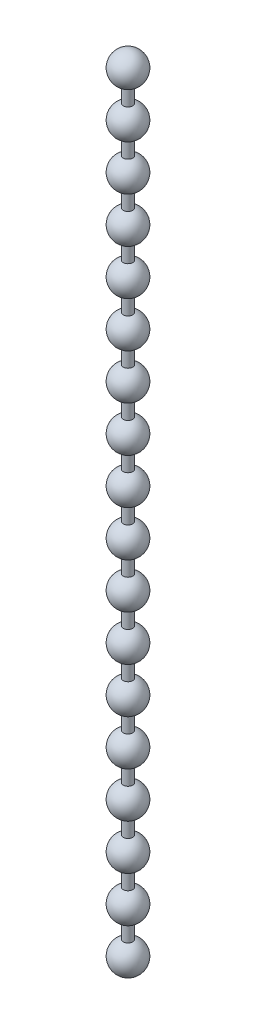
ISO-10303-21;
HEADER;
FILE_DESCRIPTION(('STEP AP214'),'2;1');
FILE_NAME('part.step','',(''),(''),'','','');
FILE_SCHEMA(('AUTOMOTIVE_DESIGN { 1 0 10303 214 1 1 1 1 }'));
ENDSEC;
DATA;
#1=APPLICATION_CONTEXT('core data for automotive mechanical design processes');
#2=APPLICATION_PROTOCOL_DEFINITION('international standard','automotive_design',2000,#1);
#3=PRODUCT_CONTEXT('',#1,'mechanical');
#4=PRODUCT('Part','Part','',(#3));
#5=PRODUCT_RELATED_PRODUCT_CATEGORY('part','',(#4));
#6=PRODUCT_DEFINITION_FORMATION('','',#4);
#7=PRODUCT_DEFINITION_CONTEXT('part definition',#1,'design');
#8=PRODUCT_DEFINITION('design','',#6,#7);
#9=PRODUCT_DEFINITION_SHAPE('','',#8);
#10=(LENGTH_UNIT() NAMED_UNIT(*) SI_UNIT(.MILLI.,.METRE.));
#11=(NAMED_UNIT(*) PLANE_ANGLE_UNIT() SI_UNIT($,.RADIAN.));
#12=(NAMED_UNIT(*) SI_UNIT($,.STERADIAN.) SOLID_ANGLE_UNIT());
#13=UNCERTAINTY_MEASURE_WITH_UNIT(LENGTH_MEASURE(1.E-05),#10,'distance_accuracy_value','');
#14=(GEOMETRIC_REPRESENTATION_CONTEXT(3) GLOBAL_UNCERTAINTY_ASSIGNED_CONTEXT((#13)) GLOBAL_UNIT_ASSIGNED_CONTEXT((#10,
#11,#12)) REPRESENTATION_CONTEXT('',''));
#15=CARTESIAN_POINT('',(0.,0.,0.));
#16=DIRECTION('',(0.,0.,1.));
#17=DIRECTION('',(1.,0.,0.));
#18=AXIS2_PLACEMENT_3D('',#15,#16,#17);
#19=CARTESIAN_POINT('',(-11.2500000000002,-198.63,-27.9452913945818));
#20=DIRECTION('',(0.,1.,0.));
#21=DIRECTION('',(1.,0.,0.));
#22=AXIS2_PLACEMENT_3D('',#19,#20,#21);
#23=SPHERICAL_SURFACE('',#22,3.25);
#24=CARTESIAN_POINT('',(-11.25,-201.88,-27.945291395));
#25=VERTEX_POINT('',#24);
#26=VERTEX_LOOP('',#25);
#27=FACE_BOUND('',#26,.T.);
#28=CARTESIAN_POINT('',(-11.25,-195.537670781,-27.945291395));
#29=DIRECTION('',(0.,1.,0.));
#30=DIRECTION('',(0.,0.,1.));
#31=AXIS2_PLACEMENT_3D('',#28,#29,#30);
#32=CIRCLE('',#31,1.);
#33=CARTESIAN_POINT('',(-11.25,-195.537670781,-26.945291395));
#34=VERTEX_POINT('',#33);
#35=EDGE_CURVE('E35',#34,#34,#32,.F.);
#36=ORIENTED_EDGE('',*,*,#35,.T.);
#37=EDGE_LOOP('',(#36));
#38=FACE_BOUND('',#37,.T.);
#39=ADVANCED_FACE('F15',(#27,#38),#23,.T.);
#40=CARTESIAN_POINT('',(-11.25,-195.537670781,-27.945291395));
#41=DIRECTION('',(0.,1.,0.));
#42=DIRECTION('',(-1.,0.,0.));
#43=AXIS2_PLACEMENT_3D('',#40,#41,#42);
#44=CYLINDRICAL_SURFACE('',#43,1.);
#45=CARTESIAN_POINT('',(-11.25,-192.222329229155,-27.945291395));
#46=DIRECTION('',(0.,1.,0.));
#47=DIRECTION('',(-1.,0.,4.18113473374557E-10));
#48=AXIS2_PLACEMENT_3D('',#45,#46,#47);
#49=CIRCLE('',#48,0.999999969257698);
#50=CARTESIAN_POINT('',(-12.2499999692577,-192.222329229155,-27.9452913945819));
#51=VERTEX_POINT('',#50);
#52=EDGE_CURVE('E37',#51,#51,#49,.F.);
#53=ORIENTED_EDGE('',*,*,#52,.T.);
#54=EDGE_LOOP('',(#53));
#55=FACE_BOUND('',#54,.T.);
#56=ORIENTED_EDGE('',*,*,#35,.F.);
#57=EDGE_LOOP('',(#56));
#58=FACE_BOUND('',#57,.T.);
#59=ADVANCED_FACE('F32',(#55,#58),#44,.T.);
#60=CARTESIAN_POINT('',(-11.2500000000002,-189.13,-27.9452913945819));
#61=DIRECTION('',(0.,1.,0.));
#62=DIRECTION('',(1.,0.,0.));
#63=AXIS2_PLACEMENT_3D('',#60,#61,#62);
#64=SPHERICAL_SURFACE('',#63,3.25);
#65=CARTESIAN_POINT('',(-11.25,-186.037670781,-27.945291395));
#66=DIRECTION('',(0.,1.,0.));
#67=DIRECTION('',(0.,0.,1.));
#68=AXIS2_PLACEMENT_3D('',#65,#66,#67);
#69=CIRCLE('',#68,1.);
#70=CARTESIAN_POINT('',(-11.25,-186.037670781,-26.945291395));
#71=VERTEX_POINT('',#70);
#72=EDGE_CURVE('E39',#71,#71,#69,.F.);
#73=ORIENTED_EDGE('',*,*,#72,.T.);
#74=EDGE_LOOP('',(#73));
#75=FACE_BOUND('',#74,.T.);
#76=ORIENTED_EDGE('',*,*,#52,.F.);
#77=EDGE_LOOP('',(#76));
#78=FACE_BOUND('',#77,.T.);
#79=ADVANCED_FACE('F46',(#75,#78),#64,.T.);
#80=CARTESIAN_POINT('',(-11.25,-186.037670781,-27.945291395));
#81=DIRECTION('',(0.,1.,0.));
#82=DIRECTION('',(0.,0.,1.));
#83=AXIS2_PLACEMENT_3D('',#80,#81,#82);
#84=CYLINDRICAL_SURFACE('',#83,1.);
#85=CARTESIAN_POINT('',(-11.25,-182.722329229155,-27.945291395));
#86=DIRECTION('',(0.,1.,0.));
#87=DIRECTION('',(-1.,0.,4.18144698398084E-10));
#88=AXIS2_PLACEMENT_3D('',#85,#86,#87);
#89=CIRCLE('',#88,0.999999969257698);
#90=CARTESIAN_POINT('',(-12.2499999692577,-182.722329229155,-27.9452913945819));
#91=VERTEX_POINT('',#90);
#92=EDGE_CURVE('E268',#91,#91,#89,.F.);
#93=ORIENTED_EDGE('',*,*,#92,.T.);
#94=EDGE_LOOP('',(#93));
#95=FACE_BOUND('',#94,.T.);
#96=ORIENTED_EDGE('',*,*,#72,.F.);
#97=EDGE_LOOP('',(#96));
#98=FACE_BOUND('',#97,.T.);
#99=ADVANCED_FACE('F49',(#95,#98),#84,.T.);
#100=CARTESIAN_POINT('',(-11.2500000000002,-179.63,-27.9452913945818));
#101=DIRECTION('',(0.,1.,0.));
#102=DIRECTION('',(1.,0.,0.));
#103=AXIS2_PLACEMENT_3D('',#100,#101,#102);
#104=SPHERICAL_SURFACE('',#103,3.25);
#105=ORIENTED_EDGE('',*,*,#92,.F.);
#106=EDGE_LOOP('',(#105));
#107=FACE_BOUND('',#106,.T.);
#108=CARTESIAN_POINT('',(-11.25,-176.537670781,-27.945291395));
#109=DIRECTION('',(0.,1.,0.));
#110=DIRECTION('',(0.,0.,1.));
#111=AXIS2_PLACEMENT_3D('',#108,#109,#110);
#112=CIRCLE('',#111,1.);
#113=CARTESIAN_POINT('',(-11.25,-176.537670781,-26.945291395));
#114=VERTEX_POINT('',#113);
#115=EDGE_CURVE('E265',#114,#114,#112,.F.);
#116=ORIENTED_EDGE('',*,*,#115,.T.);
#117=EDGE_LOOP('',(#116));
#118=FACE_BOUND('',#117,.T.);
#119=ADVANCED_FACE('F270',(#107,#118),#104,.T.);
#120=CARTESIAN_POINT('',(-11.25,-176.537670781,-27.945291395));
#121=DIRECTION('',(0.,1.,0.));
#122=DIRECTION('',(0.,0.,1.));
#123=AXIS2_PLACEMENT_3D('',#120,#121,#122);
#124=CYLINDRICAL_SURFACE('',#123,1.);
#125=ORIENTED_EDGE('',*,*,#115,.F.);
#126=EDGE_LOOP('',(#125));
#127=FACE_BOUND('',#126,.T.);
#128=CARTESIAN_POINT('',(-11.25,-173.222329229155,-27.945291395));
#129=DIRECTION('',(0.,1.,0.));
#130=DIRECTION('',(-1.,0.,4.18075309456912E-10));
#131=AXIS2_PLACEMENT_3D('',#128,#129,#130);
#132=CIRCLE('',#131,0.999999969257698);
#133=CARTESIAN_POINT('',(-12.2499999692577,-173.222329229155,-27.9452913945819));
#134=VERTEX_POINT('',#133);
#135=EDGE_CURVE('E262',#134,#134,#132,.F.);
#136=ORIENTED_EDGE('',*,*,#135,.T.);
#137=EDGE_LOOP('',(#136));
#138=FACE_BOUND('',#137,.T.);
#139=ADVANCED_FACE('F257',(#127,#138),#124,.T.);
#140=CARTESIAN_POINT('',(-11.2500000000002,-170.13,-27.9452913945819));
#141=DIRECTION('',(0.,1.,0.));
#142=DIRECTION('',(1.,0.,0.));
#143=AXIS2_PLACEMENT_3D('',#140,#141,#142);
#144=SPHERICAL_SURFACE('',#143,3.25);
#145=CARTESIAN_POINT('',(-11.25,-167.037670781,-27.945291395));
#146=DIRECTION('',(0.,1.,0.));
#147=DIRECTION('',(0.,0.,1.));
#148=AXIS2_PLACEMENT_3D('',#145,#146,#147);
#149=CIRCLE('',#148,1.);
#150=CARTESIAN_POINT('',(-11.25,-167.037670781,-26.945291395));
#151=VERTEX_POINT('',#150);
#152=EDGE_CURVE('E261',#151,#151,#149,.F.);
#153=ORIENTED_EDGE('',*,*,#152,.T.);
#154=EDGE_LOOP('',(#153));
#155=FACE_BOUND('',#154,.T.);
#156=ORIENTED_EDGE('',*,*,#135,.F.);
#157=EDGE_LOOP('',(#156));
#158=FACE_BOUND('',#157,.T.);
#159=ADVANCED_FACE('F252',(#155,#158),#144,.T.);
#160=CARTESIAN_POINT('',(-11.25,-167.037670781,-27.945291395));
#161=DIRECTION('',(0.,1.,0.));
#162=DIRECTION('',(-1.,0.,0.));
#163=AXIS2_PLACEMENT_3D('',#160,#161,#162);
#164=CYLINDRICAL_SURFACE('',#163,1.);
#165=CARTESIAN_POINT('',(-11.25,-163.722329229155,-27.945291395));
#166=DIRECTION('',(0.,1.,0.));
#167=DIRECTION('',(-1.,0.,4.18113473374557E-10));
#168=AXIS2_PLACEMENT_3D('',#165,#166,#167);
#169=CIRCLE('',#168,0.999999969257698);
#170=CARTESIAN_POINT('',(-12.2499999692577,-163.722329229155,-27.9452913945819));
#171=VERTEX_POINT('',#170);
#172=EDGE_CURVE('E241',#171,#171,#169,.F.);
#173=ORIENTED_EDGE('',*,*,#172,.T.);
#174=EDGE_LOOP('',(#173));
#175=FACE_BOUND('',#174,.T.);
#176=ORIENTED_EDGE('',*,*,#152,.F.);
#177=EDGE_LOOP('',(#176));
#178=FACE_BOUND('',#177,.T.);
#179=ADVANCED_FACE('F248',(#175,#178),#164,.T.);
#180=CARTESIAN_POINT('',(-11.2500000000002,-160.63,-27.9452913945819));
#181=DIRECTION('',(0.,1.,0.));
#182=DIRECTION('',(1.,0.,0.));
#183=AXIS2_PLACEMENT_3D('',#180,#181,#182);
#184=SPHERICAL_SURFACE('',#183,3.25);
#185=ORIENTED_EDGE('',*,*,#172,.F.);
#186=EDGE_LOOP('',(#185));
#187=FACE_BOUND('',#186,.T.);
#188=CARTESIAN_POINT('',(-11.25,-157.537670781,-27.945291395));
#189=DIRECTION('',(0.,1.,0.));
#190=DIRECTION('',(0.,0.,1.));
#191=AXIS2_PLACEMENT_3D('',#188,#189,#190);
#192=CIRCLE('',#191,1.);
#193=CARTESIAN_POINT('',(-11.25,-157.537670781,-26.945291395));
#194=VERTEX_POINT('',#193);
#195=EDGE_CURVE('E238',#194,#194,#192,.F.);
#196=ORIENTED_EDGE('',*,*,#195,.T.);
#197=EDGE_LOOP('',(#196));
#198=FACE_BOUND('',#197,.T.);
#199=ADVANCED_FACE('F245',(#187,#198),#184,.T.);
#200=CARTESIAN_POINT('',(-11.25,-157.537670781,-27.945291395));
#201=DIRECTION('',(0.,1.,0.));
#202=DIRECTION('',(0.,0.,1.));
#203=AXIS2_PLACEMENT_3D('',#200,#201,#202);
#204=CYLINDRICAL_SURFACE('',#203,1.);
#205=ORIENTED_EDGE('',*,*,#195,.F.);
#206=EDGE_LOOP('',(#205));
#207=FACE_BOUND('',#206,.T.);
#208=CARTESIAN_POINT('',(-11.25,-154.222329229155,-27.945291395));
#209=DIRECTION('',(0.,1.,0.));
#210=DIRECTION('',(-1.,0.,4.18144698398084E-10));
#211=AXIS2_PLACEMENT_3D('',#208,#209,#210);
#212=CIRCLE('',#211,0.999999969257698);
#213=CARTESIAN_POINT('',(-12.2499999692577,-154.222329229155,-27.9452913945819));
#214=VERTEX_POINT('',#213);
#215=EDGE_CURVE('E235',#214,#214,#212,.F.);
#216=ORIENTED_EDGE('',*,*,#215,.T.);
#217=EDGE_LOOP('',(#216));
#218=FACE_BOUND('',#217,.T.);
#219=ADVANCED_FACE('F229',(#207,#218),#204,.T.);
#220=CARTESIAN_POINT('',(-11.2500000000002,-151.13,-27.9452913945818));
#221=DIRECTION('',(0.,1.,0.));
#222=DIRECTION('',(1.,0.,0.));
#223=AXIS2_PLACEMENT_3D('',#220,#221,#222);
#224=SPHERICAL_SURFACE('',#223,3.25);
#225=CARTESIAN_POINT('',(-11.25,-148.037670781,-27.945291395));
#226=DIRECTION('',(0.,1.,0.));
#227=DIRECTION('',(0.,0.,1.));
#228=AXIS2_PLACEMENT_3D('',#225,#226,#227);
#229=CIRCLE('',#228,1.);
#230=CARTESIAN_POINT('',(-11.25,-148.037670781,-26.945291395));
#231=VERTEX_POINT('',#230);
#232=EDGE_CURVE('E234',#231,#231,#229,.F.);
#233=ORIENTED_EDGE('',*,*,#232,.T.);
#234=EDGE_LOOP('',(#233));
#235=FACE_BOUND('',#234,.T.);
#236=ORIENTED_EDGE('',*,*,#215,.F.);
#237=EDGE_LOOP('',(#236));
#238=FACE_BOUND('',#237,.T.);
#239=ADVANCED_FACE('F224',(#235,#238),#224,.T.);
#240=CARTESIAN_POINT('',(-11.25,-148.037670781,-27.945291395));
#241=DIRECTION('',(0.,1.,0.));
#242=DIRECTION('',(0.,0.,1.));
#243=AXIS2_PLACEMENT_3D('',#240,#241,#242);
#244=CYLINDRICAL_SURFACE('',#243,1.);
#245=CARTESIAN_POINT('',(-11.25,-144.722329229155,-27.945291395));
#246=DIRECTION('',(0.,1.,0.));
#247=DIRECTION('',(-1.,0.,4.18075309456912E-10));
#248=AXIS2_PLACEMENT_3D('',#245,#246,#247);
#249=CIRCLE('',#248,0.999999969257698);
#250=CARTESIAN_POINT('',(-12.2499999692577,-144.722329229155,-27.9452913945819));
#251=VERTEX_POINT('',#250);
#252=EDGE_CURVE('E213',#251,#251,#249,.F.);
#253=ORIENTED_EDGE('',*,*,#252,.T.);
#254=EDGE_LOOP('',(#253));
#255=FACE_BOUND('',#254,.T.);
#256=ORIENTED_EDGE('',*,*,#232,.F.);
#257=EDGE_LOOP('',(#256));
#258=FACE_BOUND('',#257,.T.);
#259=ADVANCED_FACE('F220',(#255,#258),#244,.T.);
#260=CARTESIAN_POINT('',(-11.2500000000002,-141.63,-27.9452913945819));
#261=DIRECTION('',(0.,1.,0.));
#262=DIRECTION('',(1.,0.,0.));
#263=AXIS2_PLACEMENT_3D('',#260,#261,#262);
#264=SPHERICAL_SURFACE('',#263,3.25);
#265=ORIENTED_EDGE('',*,*,#252,.F.);
#266=EDGE_LOOP('',(#265));
#267=FACE_BOUND('',#266,.T.);
#268=CARTESIAN_POINT('',(-11.25,-138.537670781,-27.945291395));
#269=DIRECTION('',(0.,1.,0.));
#270=DIRECTION('',(0.,0.,1.));
#271=AXIS2_PLACEMENT_3D('',#268,#269,#270);
#272=CIRCLE('',#271,1.);
#273=CARTESIAN_POINT('',(-11.25,-138.537670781,-26.945291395));
#274=VERTEX_POINT('',#273);
#275=EDGE_CURVE('E210',#274,#274,#272,.F.);
#276=ORIENTED_EDGE('',*,*,#275,.T.);
#277=EDGE_LOOP('',(#276));
#278=FACE_BOUND('',#277,.T.);
#279=ADVANCED_FACE('F217',(#267,#278),#264,.T.);
#280=CARTESIAN_POINT('',(-11.25,-138.537670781,-27.945291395));
#281=DIRECTION('',(0.,1.,0.));
#282=DIRECTION('',(0.,0.,1.));
#283=AXIS2_PLACEMENT_3D('',#280,#281,#282);
#284=CYLINDRICAL_SURFACE('',#283,1.);
#285=ORIENTED_EDGE('',*,*,#275,.F.);
#286=EDGE_LOOP('',(#285));
#287=FACE_BOUND('',#286,.T.);
#288=CARTESIAN_POINT('',(-11.25,-135.222329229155,-27.945291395));
#289=DIRECTION('',(0.,1.,0.));
#290=DIRECTION('',(-1.,0.,4.18113473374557E-10));
#291=AXIS2_PLACEMENT_3D('',#288,#289,#290);
#292=CIRCLE('',#291,0.999999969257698);
#293=CARTESIAN_POINT('',(-12.2499999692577,-135.222329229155,-27.9452913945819));
#294=VERTEX_POINT('',#293);
#295=EDGE_CURVE('E207',#294,#294,#292,.F.);
#296=ORIENTED_EDGE('',*,*,#295,.T.);
#297=EDGE_LOOP('',(#296));
#298=FACE_BOUND('',#297,.T.);
#299=ADVANCED_FACE('F201',(#287,#298),#284,.T.);
#300=CARTESIAN_POINT('',(-11.2500000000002,-132.13,-27.9452913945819));
#301=DIRECTION('',(0.,1.,0.));
#302=DIRECTION('',(1.,0.,0.));
#303=AXIS2_PLACEMENT_3D('',#300,#301,#302);
#304=SPHERICAL_SURFACE('',#303,3.25);
#305=CARTESIAN_POINT('',(-11.25,-129.037670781,-27.945291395));
#306=DIRECTION('',(0.,1.,0.));
#307=DIRECTION('',(0.,0.,1.));
#308=AXIS2_PLACEMENT_3D('',#305,#306,#307);
#309=CIRCLE('',#308,1.);
#310=CARTESIAN_POINT('',(-11.25,-129.037670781,-26.945291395));
#311=VERTEX_POINT('',#310);
#312=EDGE_CURVE('E206',#311,#311,#309,.F.);
#313=ORIENTED_EDGE('',*,*,#312,.T.);
#314=EDGE_LOOP('',(#313));
#315=FACE_BOUND('',#314,.T.);
#316=ORIENTED_EDGE('',*,*,#295,.F.);
#317=EDGE_LOOP('',(#316));
#318=FACE_BOUND('',#317,.T.);
#319=ADVANCED_FACE('F196',(#315,#318),#304,.T.);
#320=CARTESIAN_POINT('',(-11.25,-129.037670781,-27.945291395));
#321=DIRECTION('',(0.,1.,0.));
#322=DIRECTION('',(0.,0.,1.));
#323=AXIS2_PLACEMENT_3D('',#320,#321,#322);
#324=CYLINDRICAL_SURFACE('',#323,1.);
#325=CARTESIAN_POINT('',(-11.25,-125.722329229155,-27.945291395));
#326=DIRECTION('',(0.,1.,0.));
#327=DIRECTION('',(-1.,0.,4.18144698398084E-10));
#328=AXIS2_PLACEMENT_3D('',#325,#326,#327);
#329=CIRCLE('',#328,0.999999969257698);
#330=CARTESIAN_POINT('',(-12.2499999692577,-125.722329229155,-27.9452913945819));
#331=VERTEX_POINT('',#330);
#332=EDGE_CURVE('E185',#331,#331,#329,.F.);
#333=ORIENTED_EDGE('',*,*,#332,.T.);
#334=EDGE_LOOP('',(#333));
#335=FACE_BOUND('',#334,.T.);
#336=ORIENTED_EDGE('',*,*,#312,.F.);
#337=EDGE_LOOP('',(#336));
#338=FACE_BOUND('',#337,.T.);
#339=ADVANCED_FACE('F192',(#335,#338),#324,.T.);
#340=CARTESIAN_POINT('',(-11.2500000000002,-122.63,-27.9452913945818));
#341=DIRECTION('',(0.,1.,0.));
#342=DIRECTION('',(1.,0.,0.));
#343=AXIS2_PLACEMENT_3D('',#340,#341,#342);
#344=SPHERICAL_SURFACE('',#343,3.25);
#345=ORIENTED_EDGE('',*,*,#332,.F.);
#346=EDGE_LOOP('',(#345));
#347=FACE_BOUND('',#346,.T.);
#348=CARTESIAN_POINT('',(-11.25,-119.537670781,-27.945291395));
#349=DIRECTION('',(0.,1.,0.));
#350=DIRECTION('',(0.,0.,1.));
#351=AXIS2_PLACEMENT_3D('',#348,#349,#350);
#352=CIRCLE('',#351,1.);
#353=CARTESIAN_POINT('',(-11.25,-119.537670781,-26.945291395));
#354=VERTEX_POINT('',#353);
#355=EDGE_CURVE('E182',#354,#354,#352,.F.);
#356=ORIENTED_EDGE('',*,*,#355,.T.);
#357=EDGE_LOOP('',(#356));
#358=FACE_BOUND('',#357,.T.);
#359=ADVANCED_FACE('F189',(#347,#358),#344,.T.);
#360=CARTESIAN_POINT('',(-11.25,-119.537670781,-27.945291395));
#361=DIRECTION('',(0.,1.,0.));
#362=DIRECTION('',(-1.,0.,0.));
#363=AXIS2_PLACEMENT_3D('',#360,#361,#362);
#364=CYLINDRICAL_SURFACE('',#363,1.);
#365=ORIENTED_EDGE('',*,*,#355,.F.);
#366=EDGE_LOOP('',(#365));
#367=FACE_BOUND('',#366,.T.);
#368=CARTESIAN_POINT('',(-11.25,-116.222329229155,-27.945291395));
#369=DIRECTION('',(0.,1.,0.));
#370=DIRECTION('',(-1.,0.,4.18075309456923E-10));
#371=AXIS2_PLACEMENT_3D('',#368,#369,#370);
#372=CIRCLE('',#371,0.99999996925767);
#373=CARTESIAN_POINT('',(-12.2499999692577,-116.222329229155,-27.9452913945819));
#374=VERTEX_POINT('',#373);
#375=EDGE_CURVE('E179',#374,#374,#372,.F.);
#376=ORIENTED_EDGE('',*,*,#375,.T.);
#377=EDGE_LOOP('',(#376));
#378=FACE_BOUND('',#377,.T.);
#379=ADVANCED_FACE('F173',(#367,#378),#364,.T.);
#380=CARTESIAN_POINT('',(-11.2500000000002,-113.13,-27.9452913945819));
#381=DIRECTION('',(0.,1.,0.));
#382=DIRECTION('',(1.,0.,0.));
#383=AXIS2_PLACEMENT_3D('',#380,#381,#382);
#384=SPHERICAL_SURFACE('',#383,3.25);
#385=CARTESIAN_POINT('',(-11.25,-110.037670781,-27.945291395));
#386=DIRECTION('',(0.,1.,0.));
#387=DIRECTION('',(0.,0.,1.));
#388=AXIS2_PLACEMENT_3D('',#385,#386,#387);
#389=CIRCLE('',#388,1.);
#390=CARTESIAN_POINT('',(-11.25,-110.037670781,-26.945291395));
#391=VERTEX_POINT('',#390);
#392=EDGE_CURVE('E178',#391,#391,#389,.F.);
#393=ORIENTED_EDGE('',*,*,#392,.T.);
#394=EDGE_LOOP('',(#393));
#395=FACE_BOUND('',#394,.T.);
#396=ORIENTED_EDGE('',*,*,#375,.F.);
#397=EDGE_LOOP('',(#396));
#398=FACE_BOUND('',#397,.T.);
#399=ADVANCED_FACE('F168',(#395,#398),#384,.T.);
#400=CARTESIAN_POINT('',(-11.25,-110.037670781,-27.945291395));
#401=DIRECTION('',(0.,1.,0.));
#402=DIRECTION('',(-1.,0.,0.));
#403=AXIS2_PLACEMENT_3D('',#400,#401,#402);
#404=CYLINDRICAL_SURFACE('',#403,1.);
#405=CARTESIAN_POINT('',(-11.25,-106.722329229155,-27.945291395));
#406=DIRECTION('',(0.,1.,0.));
#407=DIRECTION('',(-1.,0.,4.18120412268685E-10));
#408=AXIS2_PLACEMENT_3D('',#405,#406,#407);
#409=CIRCLE('',#408,0.99999996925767);
#410=CARTESIAN_POINT('',(-12.2499999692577,-106.722329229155,-27.9452913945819));
#411=VERTEX_POINT('',#410);
#412=EDGE_CURVE('E157',#411,#411,#409,.F.);
#413=ORIENTED_EDGE('',*,*,#412,.T.);
#414=EDGE_LOOP('',(#413));
#415=FACE_BOUND('',#414,.T.);
#416=ORIENTED_EDGE('',*,*,#392,.F.);
#417=EDGE_LOOP('',(#416));
#418=FACE_BOUND('',#417,.T.);
#419=ADVANCED_FACE('F164',(#415,#418),#404,.T.);
#420=CARTESIAN_POINT('',(-11.2500000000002,-103.63,-27.9452913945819));
#421=DIRECTION('',(0.,1.,0.));
#422=DIRECTION('',(1.,0.,0.));
#423=AXIS2_PLACEMENT_3D('',#420,#421,#422);
#424=SPHERICAL_SURFACE('',#423,3.25);
#425=ORIENTED_EDGE('',*,*,#412,.F.);
#426=EDGE_LOOP('',(#425));
#427=FACE_BOUND('',#426,.T.);
#428=CARTESIAN_POINT('',(-11.25,-100.537670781,-27.945291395));
#429=DIRECTION('',(0.,1.,0.));
#430=DIRECTION('',(0.,0.,1.));
#431=AXIS2_PLACEMENT_3D('',#428,#429,#430);
#432=CIRCLE('',#431,1.);
#433=CARTESIAN_POINT('',(-11.25,-100.537670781,-26.945291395));
#434=VERTEX_POINT('',#433);
#435=EDGE_CURVE('E154',#434,#434,#432,.F.);
#436=ORIENTED_EDGE('',*,*,#435,.T.);
#437=EDGE_LOOP('',(#436));
#438=FACE_BOUND('',#437,.T.);
#439=ADVANCED_FACE('F161',(#427,#438),#424,.T.);
#440=CARTESIAN_POINT('',(-11.25,-100.537670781,-27.945291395));
#441=DIRECTION('',(0.,1.,0.));
#442=DIRECTION('',(-1.,0.,0.));
#443=AXIS2_PLACEMENT_3D('',#440,#441,#442);
#444=CYLINDRICAL_SURFACE('',#443,1.);
#445=ORIENTED_EDGE('',*,*,#435,.F.);
#446=EDGE_LOOP('',(#445));
#447=FACE_BOUND('',#446,.T.);
#448=CARTESIAN_POINT('',(-11.25,-97.2223292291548,-27.945291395));
#449=DIRECTION('',(0.,1.,0.));
#450=DIRECTION('',(-1.,0.,4.18151637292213E-10));
#451=AXIS2_PLACEMENT_3D('',#448,#449,#450);
#452=CIRCLE('',#451,0.99999996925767);
#453=CARTESIAN_POINT('',(-12.2499999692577,-97.2223292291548,-27.9452913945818));
#454=VERTEX_POINT('',#453);
#455=EDGE_CURVE('E151',#454,#454,#452,.F.);
#456=ORIENTED_EDGE('',*,*,#455,.T.);
#457=EDGE_LOOP('',(#456));
#458=FACE_BOUND('',#457,.T.);
#459=ADVANCED_FACE('F145',(#447,#458),#444,.T.);
#460=CARTESIAN_POINT('',(-11.2500000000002,-94.13,-27.9452913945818));
#461=DIRECTION('',(0.,1.,0.));
#462=DIRECTION('',(1.,0.,0.));
#463=AXIS2_PLACEMENT_3D('',#460,#461,#462);
#464=SPHERICAL_SURFACE('',#463,3.25);
#465=CARTESIAN_POINT('',(-11.25,-91.037670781,-27.945291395));
#466=DIRECTION('',(0.,1.,0.));
#467=DIRECTION('',(0.,0.,1.));
#468=AXIS2_PLACEMENT_3D('',#465,#466,#467);
#469=CIRCLE('',#468,1.);
#470=CARTESIAN_POINT('',(-11.25,-91.037670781,-26.945291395));
#471=VERTEX_POINT('',#470);
#472=EDGE_CURVE('E150',#471,#471,#469,.F.);
#473=ORIENTED_EDGE('',*,*,#472,.T.);
#474=EDGE_LOOP('',(#473));
#475=FACE_BOUND('',#474,.T.);
#476=ORIENTED_EDGE('',*,*,#455,.F.);
#477=EDGE_LOOP('',(#476));
#478=FACE_BOUND('',#477,.T.);
#479=ADVANCED_FACE('F140',(#475,#478),#464,.T.);
#480=CARTESIAN_POINT('',(-11.25,-91.037670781,-27.945291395));
#481=DIRECTION('',(0.,1.,0.));
#482=DIRECTION('',(0.,0.,1.));
#483=AXIS2_PLACEMENT_3D('',#480,#481,#482);
#484=CYLINDRICAL_SURFACE('',#483,1.);
#485=CARTESIAN_POINT('',(-11.25,-87.7223292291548,-27.945291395));
#486=DIRECTION('',(0.,1.,0.));
#487=DIRECTION('',(-1.,0.,4.18182862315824E-10));
#488=AXIS2_PLACEMENT_3D('',#485,#486,#487);
#489=CIRCLE('',#488,0.999999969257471);
#490=CARTESIAN_POINT('',(-12.2499999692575,-87.7223292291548,-27.9452913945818));
#491=VERTEX_POINT('',#490);
#492=EDGE_CURVE('E129',#491,#491,#489,.F.);
#493=ORIENTED_EDGE('',*,*,#492,.T.);
#494=EDGE_LOOP('',(#493));
#495=FACE_BOUND('',#494,.T.);
#496=ORIENTED_EDGE('',*,*,#472,.F.);
#497=EDGE_LOOP('',(#496));
#498=FACE_BOUND('',#497,.T.);
#499=ADVANCED_FACE('F136',(#495,#498),#484,.T.);
#500=CARTESIAN_POINT('',(-11.25,-84.63,-27.9452913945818));
#501=DIRECTION('',(0.,1.,0.));
#502=DIRECTION('',(1.,0.,0.));
#503=AXIS2_PLACEMENT_3D('',#500,#501,#502);
#504=SPHERICAL_SURFACE('',#503,3.25);
#505=ORIENTED_EDGE('',*,*,#492,.F.);
#506=EDGE_LOOP('',(#505));
#507=FACE_BOUND('',#506,.T.);
#508=CARTESIAN_POINT('',(-11.25,-81.537670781,-27.945291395));
#509=DIRECTION('',(0.,1.,0.));
#510=DIRECTION('',(0.,0.,1.));
#511=AXIS2_PLACEMENT_3D('',#508,#509,#510);
#512=CIRCLE('',#511,1.);
#513=CARTESIAN_POINT('',(-11.25,-81.537670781,-26.945291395));
#514=VERTEX_POINT('',#513);
#515=EDGE_CURVE('E126',#514,#514,#512,.F.);
#516=ORIENTED_EDGE('',*,*,#515,.T.);
#517=EDGE_LOOP('',(#516));
#518=FACE_BOUND('',#517,.T.);
#519=ADVANCED_FACE('F133',(#507,#518),#504,.T.);
#520=CARTESIAN_POINT('',(-11.25,-81.537670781,-27.945291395));
#521=DIRECTION('',(0.,1.,0.));
#522=DIRECTION('',(0.,0.,1.));
#523=AXIS2_PLACEMENT_3D('',#520,#521,#522);
#524=CYLINDRICAL_SURFACE('',#523,1.);
#525=ORIENTED_EDGE('',*,*,#515,.F.);
#526=EDGE_LOOP('',(#525));
#527=FACE_BOUND('',#526,.T.);
#528=CARTESIAN_POINT('',(-11.25,-78.2223292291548,-27.945291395));
#529=DIRECTION('',(0.,1.,0.));
#530=DIRECTION('',(-1.,0.,4.18120412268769E-10));
#531=AXIS2_PLACEMENT_3D('',#528,#529,#530);
#532=CIRCLE('',#531,0.999999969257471);
#533=CARTESIAN_POINT('',(-12.2499999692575,-78.2223292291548,-27.9452913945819));
#534=VERTEX_POINT('',#533);
#535=EDGE_CURVE('E123',#534,#534,#532,.F.);
#536=ORIENTED_EDGE('',*,*,#535,.T.);
#537=EDGE_LOOP('',(#536));
#538=FACE_BOUND('',#537,.T.);
#539=ADVANCED_FACE('F117',(#527,#538),#524,.T.);
#540=CARTESIAN_POINT('',(-11.25,-75.13,-27.9452913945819));
#541=DIRECTION('',(0.,1.,0.));
#542=DIRECTION('',(1.,0.,0.));
#543=AXIS2_PLACEMENT_3D('',#540,#541,#542);
#544=SPHERICAL_SURFACE('',#543,3.25);
#545=CARTESIAN_POINT('',(-11.25,-72.037670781,-27.945291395));
#546=DIRECTION('',(0.,1.,0.));
#547=DIRECTION('',(0.,0.,1.));
#548=AXIS2_PLACEMENT_3D('',#545,#546,#547);
#549=CIRCLE('',#548,1.);
#550=CARTESIAN_POINT('',(-11.25,-72.037670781,-26.945291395));
#551=VERTEX_POINT('',#550);
#552=EDGE_CURVE('E122',#551,#551,#549,.F.);
#553=ORIENTED_EDGE('',*,*,#552,.T.);
#554=EDGE_LOOP('',(#553));
#555=FACE_BOUND('',#554,.T.);
#556=ORIENTED_EDGE('',*,*,#535,.F.);
#557=EDGE_LOOP('',(#556));
#558=FACE_BOUND('',#557,.T.);
#559=ADVANCED_FACE('F112',(#555,#558),#544,.T.);
#560=CARTESIAN_POINT('',(-11.25,-72.037670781,-27.945291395));
#561=DIRECTION('',(0.,1.,0.));
#562=DIRECTION('',(0.,0.,1.));
#563=AXIS2_PLACEMENT_3D('',#560,#561,#562);
#564=CYLINDRICAL_SURFACE('',#563,1.);
#565=CARTESIAN_POINT('',(-11.25,-68.7223292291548,-27.945291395));
#566=DIRECTION('',(0.,1.,0.));
#567=DIRECTION('',(-1.,0.,4.18151637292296E-10));
#568=AXIS2_PLACEMENT_3D('',#565,#566,#567);
#569=CIRCLE('',#568,0.999999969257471);
#570=CARTESIAN_POINT('',(-12.2499999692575,-68.7223292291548,-27.9452913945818));
#571=VERTEX_POINT('',#570);
#572=EDGE_CURVE('E101',#571,#571,#569,.F.);
#573=ORIENTED_EDGE('',*,*,#572,.T.);
#574=EDGE_LOOP('',(#573));
#575=FACE_BOUND('',#574,.T.);
#576=ORIENTED_EDGE('',*,*,#552,.F.);
#577=EDGE_LOOP('',(#576));
#578=FACE_BOUND('',#577,.T.);
#579=ADVANCED_FACE('F108',(#575,#578),#564,.T.);
#580=CARTESIAN_POINT('',(-11.25,-65.63,-27.9452913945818));
#581=DIRECTION('',(0.,1.,0.));
#582=DIRECTION('',(1.,0.,0.));
#583=AXIS2_PLACEMENT_3D('',#580,#581,#582);
#584=SPHERICAL_SURFACE('',#583,3.25);
#585=ORIENTED_EDGE('',*,*,#572,.F.);
#586=EDGE_LOOP('',(#585));
#587=FACE_BOUND('',#586,.T.);
#588=CARTESIAN_POINT('',(-11.25,-62.537670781,-27.945291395));
#589=DIRECTION('',(0.,1.,0.));
#590=DIRECTION('',(0.,0.,1.));
#591=AXIS2_PLACEMENT_3D('',#588,#589,#590);
#592=CIRCLE('',#591,1.);
#593=CARTESIAN_POINT('',(-11.25,-62.537670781,-26.945291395));
#594=VERTEX_POINT('',#593);
#595=EDGE_CURVE('E98',#594,#594,#592,.F.);
#596=ORIENTED_EDGE('',*,*,#595,.T.);
#597=EDGE_LOOP('',(#596));
#598=FACE_BOUND('',#597,.T.);
#599=ADVANCED_FACE('F105',(#587,#598),#584,.T.);
#600=CARTESIAN_POINT('',(-11.25,-62.537670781,-27.945291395));
#601=DIRECTION('',(0.,1.,0.));
#602=DIRECTION('',(0.,0.,1.));
#603=AXIS2_PLACEMENT_3D('',#600,#601,#602);
#604=CYLINDRICAL_SURFACE('',#603,1.);
#605=ORIENTED_EDGE('',*,*,#595,.F.);
#606=EDGE_LOOP('',(#605));
#607=FACE_BOUND('',#606,.T.);
#608=CARTESIAN_POINT('',(-11.25,-59.2223292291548,-27.945291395));
#609=DIRECTION('',(0.,1.,0.));
#610=DIRECTION('',(-1.,0.,4.1808224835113E-10));
#611=AXIS2_PLACEMENT_3D('',#608,#609,#610);
#612=CIRCLE('',#611,0.999999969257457);
#613=CARTESIAN_POINT('',(-12.2499999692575,-59.2223292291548,-27.9452913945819));
#614=VERTEX_POINT('',#613);
#615=EDGE_CURVE('E95',#614,#614,#612,.F.);
#616=ORIENTED_EDGE('',*,*,#615,.T.);
#617=EDGE_LOOP('',(#616));
#618=FACE_BOUND('',#617,.T.);
#619=ADVANCED_FACE('F89',(#607,#618),#604,.T.);
#620=CARTESIAN_POINT('',(-11.25,-56.13,-27.9452913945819));
#621=DIRECTION('',(0.,1.,0.));
#622=DIRECTION('',(1.,0.,0.));
#623=AXIS2_PLACEMENT_3D('',#620,#621,#622);
#624=SPHERICAL_SURFACE('',#623,3.25);
#625=CARTESIAN_POINT('',(-11.25,-53.037670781,-27.945291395));
#626=DIRECTION('',(0.,1.,0.));
#627=DIRECTION('',(0.,0.,1.));
#628=AXIS2_PLACEMENT_3D('',#625,#626,#627);
#629=CIRCLE('',#628,1.);
#630=CARTESIAN_POINT('',(-11.25,-53.037670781,-26.945291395));
#631=VERTEX_POINT('',#630);
#632=EDGE_CURVE('E94',#631,#631,#629,.F.);
#633=ORIENTED_EDGE('',*,*,#632,.T.);
#634=EDGE_LOOP('',(#633));
#635=FACE_BOUND('',#634,.T.);
#636=ORIENTED_EDGE('',*,*,#615,.F.);
#637=EDGE_LOOP('',(#636));
#638=FACE_BOUND('',#637,.T.);
#639=ADVANCED_FACE('F84',(#635,#638),#624,.T.);
#640=CARTESIAN_POINT('',(-11.25,-53.037670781,-27.945291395));
#641=DIRECTION('',(0.,1.,0.));
#642=DIRECTION('',(0.,0.,1.));
#643=AXIS2_PLACEMENT_3D('',#640,#641,#642);
#644=CYLINDRICAL_SURFACE('',#643,1.);
#645=CARTESIAN_POINT('',(-11.25,-49.7223292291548,-27.945291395));
#646=DIRECTION('',(0.,1.,0.));
#647=DIRECTION('',(-1.,0.,4.18120412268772E-10));
#648=AXIS2_PLACEMENT_3D('',#645,#646,#647);
#649=CIRCLE('',#648,0.999999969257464);
#650=CARTESIAN_POINT('',(-12.2499999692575,-49.7223292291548,-27.9452913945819));
#651=VERTEX_POINT('',#650);
#652=EDGE_CURVE('E74',#651,#651,#649,.F.);
#653=ORIENTED_EDGE('',*,*,#652,.T.);
#654=EDGE_LOOP('',(#653));
#655=FACE_BOUND('',#654,.T.);
#656=ORIENTED_EDGE('',*,*,#632,.F.);
#657=EDGE_LOOP('',(#656));
#658=FACE_BOUND('',#657,.T.);
#659=ADVANCED_FACE('F80',(#655,#658),#644,.T.);
#660=CARTESIAN_POINT('',(-11.25,-46.63,-27.9452913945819));
#661=DIRECTION('',(0.,1.,0.));
#662=DIRECTION('',(1.,0.,0.));
#663=AXIS2_PLACEMENT_3D('',#660,#661,#662);
#664=SPHERICAL_SURFACE('',#663,3.25);
#665=ORIENTED_EDGE('',*,*,#652,.F.);
#666=EDGE_LOOP('',(#665));
#667=FACE_BOUND('',#666,.T.);
#668=CARTESIAN_POINT('',(-11.25,-43.537670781,-27.945291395));
#669=DIRECTION('',(0.,1.,0.));
#670=DIRECTION('',(0.,0.,1.));
#671=AXIS2_PLACEMENT_3D('',#668,#669,#670);
#672=CIRCLE('',#671,1.);
#673=CARTESIAN_POINT('',(-11.25,-43.537670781,-26.945291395));
#674=VERTEX_POINT('',#673);
#675=EDGE_CURVE('E24',#674,#674,#672,.F.);
#676=ORIENTED_EDGE('',*,*,#675,.T.);
#677=EDGE_LOOP('',(#676));
#678=FACE_BOUND('',#677,.T.);
#679=ADVANCED_FACE('F64',(#667,#678),#664,.T.);
#680=CARTESIAN_POINT('',(-11.25,-43.537670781,-27.945291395));
#681=DIRECTION('',(0.,1.,0.));
#682=DIRECTION('',(-1.,0.,0.));
#683=AXIS2_PLACEMENT_3D('',#680,#681,#682);
#684=CYLINDRICAL_SURFACE('',#683,1.);
#685=ORIENTED_EDGE('',*,*,#675,.F.);
#686=EDGE_LOOP('',(#685));
#687=FACE_BOUND('',#686,.T.);
#688=CARTESIAN_POINT('',(-11.25,-40.2223292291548,-27.945291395));
#689=DIRECTION('',(0.,1.,0.));
#690=DIRECTION('',(-1.,0.,4.18151637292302E-10));
#691=AXIS2_PLACEMENT_3D('',#688,#689,#690);
#692=CIRCLE('',#691,0.999999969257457);
#693=CARTESIAN_POINT('',(-12.2499999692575,-40.2223292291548,-27.9452913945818));
#694=VERTEX_POINT('',#693);
#695=EDGE_CURVE('E10',#694,#694,#692,.F.);
#696=ORIENTED_EDGE('',*,*,#695,.T.);
#697=EDGE_LOOP('',(#696));
#698=FACE_BOUND('',#697,.T.);
#699=ADVANCED_FACE('F59',(#687,#698),#684,.T.);
#700=CARTESIAN_POINT('',(-11.25,-37.13,-27.9452913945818));
#701=DIRECTION('',(0.,1.,0.));
#702=DIRECTION('',(1.,0.,0.));
#703=AXIS2_PLACEMENT_3D('',#700,#701,#702);
#704=SPHERICAL_SURFACE('',#703,3.25);
#705=CARTESIAN_POINT('',(-11.25,-33.88,-27.945291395));
#706=VERTEX_POINT('',#705);
#707=VERTEX_LOOP('',#706);
#708=FACE_BOUND('',#707,.T.);
#709=ORIENTED_EDGE('',*,*,#695,.F.);
#710=EDGE_LOOP('',(#709));
#711=FACE_BOUND('',#710,.T.);
#712=ADVANCED_FACE('F57',(#708,#711),#704,.T.);
#713=CLOSED_SHELL('',(#39,#59,#79,#99,#119,#139,#159,#179,#199,#219,#239,#259,#279,#299,#319,
#339,#359,#379,#399,#419,#439,#459,#479,#499,#519,#539,#559,#579,#599,#619,#639,#659,#679,#699,#712));
#714=MANIFOLD_SOLID_BREP('B1',#713);
#715=ADVANCED_BREP_SHAPE_REPRESENTATION('',(#18,#714),#14);
#716=SHAPE_DEFINITION_REPRESENTATION(#9,#715);
ENDSEC;
END-ISO-10303-21;
